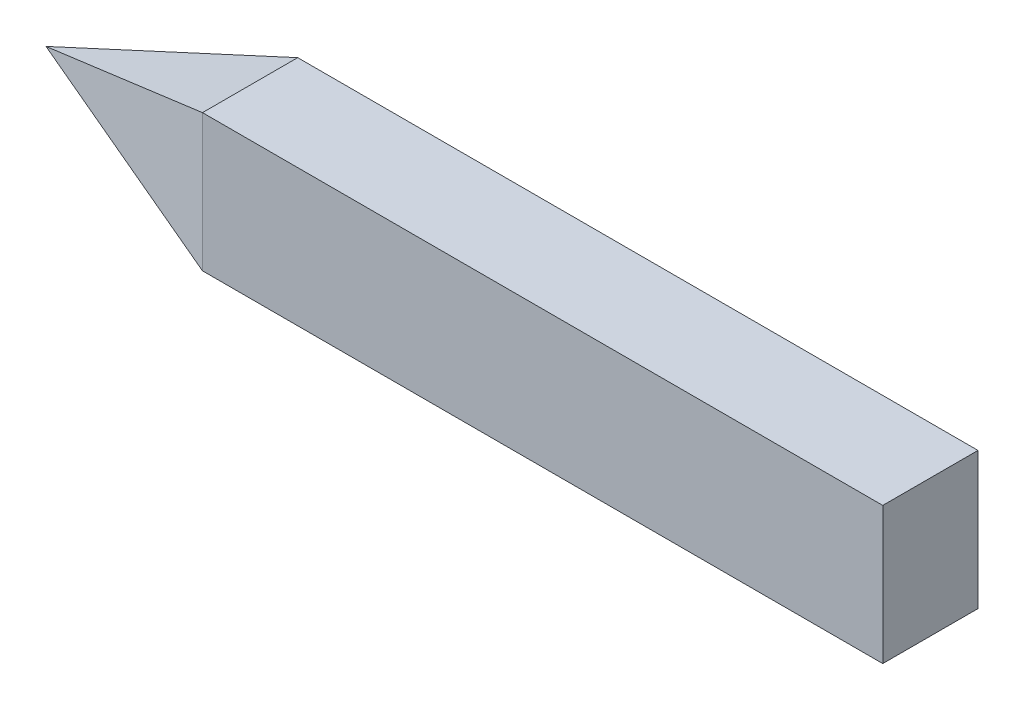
ISO-10303-21;
HEADER;
FILE_DESCRIPTION(('STEP AP214'),'2;1');
FILE_NAME('part.step','',(''),(''),'','','');
FILE_SCHEMA(('AUTOMOTIVE_DESIGN { 1 0 10303 214 1 1 1 1 }'));
ENDSEC;
DATA;
#1=APPLICATION_CONTEXT('core data for automotive mechanical design processes');
#2=APPLICATION_PROTOCOL_DEFINITION('international standard','automotive_design',2000,#1);
#3=PRODUCT_CONTEXT('',#1,'mechanical');
#4=PRODUCT('Part','Part','',(#3));
#5=PRODUCT_RELATED_PRODUCT_CATEGORY('part','',(#4));
#6=PRODUCT_DEFINITION_FORMATION('','',#4);
#7=PRODUCT_DEFINITION_CONTEXT('part definition',#1,'design');
#8=PRODUCT_DEFINITION('design','',#6,#7);
#9=PRODUCT_DEFINITION_SHAPE('','',#8);
#10=(LENGTH_UNIT() NAMED_UNIT(*) SI_UNIT(.MILLI.,.METRE.));
#11=(NAMED_UNIT(*) PLANE_ANGLE_UNIT() SI_UNIT($,.RADIAN.));
#12=(NAMED_UNIT(*) SI_UNIT($,.STERADIAN.) SOLID_ANGLE_UNIT());
#13=UNCERTAINTY_MEASURE_WITH_UNIT(LENGTH_MEASURE(1.E-05),#10,'distance_accuracy_value','');
#14=(GEOMETRIC_REPRESENTATION_CONTEXT(3) GLOBAL_UNCERTAINTY_ASSIGNED_CONTEXT((#13)) GLOBAL_UNIT_ASSIGNED_CONTEXT((#10,
#11,#12)) REPRESENTATION_CONTEXT('',''));
#15=CARTESIAN_POINT('',(0.,0.,0.));
#16=DIRECTION('',(0.,0.,1.));
#17=DIRECTION('',(1.,0.,0.));
#18=AXIS2_PLACEMENT_3D('',#15,#16,#17);
#19=CARTESIAN_POINT('',(0.,0.,0.));
#20=DIRECTION('',(0.227229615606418,0.,-0.973841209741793));
#21=DIRECTION('',(-0.973841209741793,0.,-0.227229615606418));
#22=AXIS2_PLACEMENT_3D('',#19,#20,#21);
#23=PLANE('',#22);
#24=DIRECTION('',(0.,-1.,0.));
#25=VECTOR('',#24,1.);
#26=CARTESIAN_POINT('',(75.,-109.084049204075,17.5));
#27=LINE('',#26,#25);
#28=CARTESIAN_POINT('',(75.,25.1732421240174,17.5));
#29=VERTEX_POINT('',#28);
#30=CARTESIAN_POINT('',(75.,-25.1732421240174,17.5));
#31=VERTEX_POINT('',#30);
#32=EDGE_CURVE('E74',#29,#31,#27,.T.);
#33=ORIENTED_EDGE('',*,*,#32,.F.);
#34=DIRECTION('',(0.925647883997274,0.310687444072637,0.215984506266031));
#35=VECTOR('',#34,1.);
#36=CARTESIAN_POINT('',(75.,25.1732421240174,17.5));
#37=LINE('',#36,#35);
#38=CARTESIAN_POINT('',(0.,0.,0.));
#39=VERTEX_POINT('',#38);
#40=EDGE_CURVE('E44',#39,#29,#37,.T.);
#41=ORIENTED_EDGE('',*,*,#40,.F.);
#42=DIRECTION('',(-0.925647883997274,0.310687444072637,-0.215984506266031));
#43=VECTOR('',#42,1.);
#44=CARTESIAN_POINT('',(3.49869802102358,-1.17431429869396,0.81636287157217));
#45=LINE('',#44,#43);
#46=EDGE_CURVE('E12',#31,#39,#45,.T.);
#47=ORIENTED_EDGE('',*,*,#46,.F.);
#48=EDGE_LOOP('',(#33,#41,#47));
#49=FACE_BOUND('',#48,.T.);
#50=ADVANCED_FACE('F36',(#49),#23,.F.);
#51=CARTESIAN_POINT('',(325.,-109.084049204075,-17.5));
#52=DIRECTION('',(0.,0.,-1.));
#53=DIRECTION('',(-1.,0.,0.));
#54=AXIS2_PLACEMENT_3D('',#51,#52,#53);
#55=PLANE('',#54);
#56=DIRECTION('',(0.,-1.,0.));
#57=VECTOR('',#56,1.);
#58=CARTESIAN_POINT('',(75.,-109.084049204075,-17.5));
#59=LINE('',#58,#57);
#60=CARTESIAN_POINT('',(75.,25.1732421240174,-17.5));
#61=VERTEX_POINT('',#60);
#62=CARTESIAN_POINT('',(75.,-25.1732421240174,-17.5));
#63=VERTEX_POINT('',#62);
#64=EDGE_CURVE('E117',#61,#63,#59,.T.);
#65=ORIENTED_EDGE('',*,*,#64,.F.);
#66=DIRECTION('',(-1.,0.,0.));
#67=VECTOR('',#66,1.);
#68=CARTESIAN_POINT('',(75.,25.1732421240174,-17.5));
#69=LINE('',#68,#67);
#70=CARTESIAN_POINT('',(325.,25.1732421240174,-17.5));
#71=VERTEX_POINT('',#70);
#72=EDGE_CURVE('E92',#71,#61,#69,.T.);
#73=ORIENTED_EDGE('',*,*,#72,.F.);
#74=DIRECTION('',(0.,1.,0.));
#75=VECTOR('',#74,1.);
#76=CARTESIAN_POINT('',(325.,25.1732421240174,-17.5));
#77=LINE('',#76,#75);
#78=CARTESIAN_POINT('',(325.,-25.1732421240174,-17.5));
#79=VERTEX_POINT('',#78);
#80=EDGE_CURVE('E108',#79,#71,#77,.T.);
#81=ORIENTED_EDGE('',*,*,#80,.F.);
#82=DIRECTION('',(1.,0.,0.));
#83=VECTOR('',#82,1.);
#84=CARTESIAN_POINT('',(75.,-25.1732421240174,-17.5));
#85=LINE('',#84,#83);
#86=EDGE_CURVE('E52',#63,#79,#85,.T.);
#87=ORIENTED_EDGE('',*,*,#86,.F.);
#88=EDGE_LOOP('',(#65,#73,#81,#87));
#89=FACE_BOUND('',#88,.T.);
#90=ADVANCED_FACE('F128',(#89),#55,.T.);
#91=CARTESIAN_POINT('',(325.,25.1732421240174,17.5));
#92=DIRECTION('',(-1.,0.,0.));
#93=DIRECTION('',(0.,0.,1.));
#94=AXIS2_PLACEMENT_3D('',#91,#92,#93);
#95=PLANE('',#94);
#96=ORIENTED_EDGE('',*,*,#80,.T.);
#97=DIRECTION('',(0.,0.,-1.));
#98=VECTOR('',#97,1.);
#99=CARTESIAN_POINT('',(325.,25.1732421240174,17.5));
#100=LINE('',#99,#98);
#101=CARTESIAN_POINT('',(325.,25.1732421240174,17.5));
#102=VERTEX_POINT('',#101);
#103=EDGE_CURVE('E98',#102,#71,#100,.T.);
#104=ORIENTED_EDGE('',*,*,#103,.F.);
#105=DIRECTION('',(0.,1.,0.));
#106=VECTOR('',#105,1.);
#107=CARTESIAN_POINT('',(325.,25.1732421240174,17.5));
#108=LINE('',#107,#106);
#109=CARTESIAN_POINT('',(325.,-25.1732421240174,17.5));
#110=VERTEX_POINT('',#109);
#111=EDGE_CURVE('E93',#110,#102,#108,.T.);
#112=ORIENTED_EDGE('',*,*,#111,.F.);
#113=DIRECTION('',(0.,0.,-1.));
#114=VECTOR('',#113,1.);
#115=CARTESIAN_POINT('',(325.,-25.1732421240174,17.5));
#116=LINE('',#115,#114);
#117=EDGE_CURVE('E90',#110,#79,#116,.T.);
#118=ORIENTED_EDGE('',*,*,#117,.T.);
#119=EDGE_LOOP('',(#96,#104,#112,#118));
#120=FACE_BOUND('',#119,.T.);
#121=ADVANCED_FACE('F133',(#120),#95,.F.);
#122=CARTESIAN_POINT('',(75.,-25.1732421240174,17.5));
#123=DIRECTION('',(0.,1.,0.));
#124=DIRECTION('',(0.,0.,1.));
#125=AXIS2_PLACEMENT_3D('',#122,#123,#124);
#126=PLANE('',#125);
#127=ORIENTED_EDGE('',*,*,#86,.T.);
#128=ORIENTED_EDGE('',*,*,#117,.F.);
#129=DIRECTION('',(1.,0.,0.));
#130=VECTOR('',#129,1.);
#131=CARTESIAN_POINT('',(75.,-25.1732421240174,17.5));
#132=LINE('',#131,#130);
#133=EDGE_CURVE('E69',#31,#110,#132,.T.);
#134=ORIENTED_EDGE('',*,*,#133,.F.);
#135=DIRECTION('',(0.,0.,-1.));
#136=VECTOR('',#135,1.);
#137=CARTESIAN_POINT('',(75.,-25.1732421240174,17.5));
#138=LINE('',#137,#136);
#139=EDGE_CURVE('E85',#31,#63,#138,.T.);
#140=ORIENTED_EDGE('',*,*,#139,.T.);
#141=EDGE_LOOP('',(#127,#128,#134,#140));
#142=FACE_BOUND('',#141,.T.);
#143=ADVANCED_FACE('F88',(#142),#126,.F.);
#144=CARTESIAN_POINT('',(75.,25.1732421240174,17.5));
#145=DIRECTION('',(0.,-1.,0.));
#146=DIRECTION('',(0.,0.,-1.));
#147=AXIS2_PLACEMENT_3D('',#144,#145,#146);
#148=PLANE('',#147);
#149=ORIENTED_EDGE('',*,*,#72,.T.);
#150=DIRECTION('',(0.,0.,-1.));
#151=VECTOR('',#150,1.);
#152=CARTESIAN_POINT('',(75.,25.1732421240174,17.5));
#153=LINE('',#152,#151);
#154=EDGE_CURVE('E103',#29,#61,#153,.T.);
#155=ORIENTED_EDGE('',*,*,#154,.F.);
#156=DIRECTION('',(-1.,0.,0.));
#157=VECTOR('',#156,1.);
#158=CARTESIAN_POINT('',(75.,25.1732421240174,17.5));
#159=LINE('',#158,#157);
#160=EDGE_CURVE('E82',#102,#29,#159,.T.);
#161=ORIENTED_EDGE('',*,*,#160,.F.);
#162=ORIENTED_EDGE('',*,*,#103,.T.);
#163=EDGE_LOOP('',(#149,#155,#161,#162));
#164=FACE_BOUND('',#163,.T.);
#165=ADVANCED_FACE('F135',(#164),#148,.F.);
#166=CARTESIAN_POINT('',(325.,-109.084049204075,17.5));
#167=DIRECTION('',(0.,0.,-1.));
#168=DIRECTION('',(-1.,0.,0.));
#169=AXIS2_PLACEMENT_3D('',#166,#167,#168);
#170=PLANE('',#169);
#171=ORIENTED_EDGE('',*,*,#160,.T.);
#172=ORIENTED_EDGE('',*,*,#32,.T.);
#173=ORIENTED_EDGE('',*,*,#133,.T.);
#174=ORIENTED_EDGE('',*,*,#111,.T.);
#175=EDGE_LOOP('',(#171,#172,#173,#174));
#176=FACE_BOUND('',#175,.T.);
#177=ADVANCED_FACE('F80',(#176),#170,.F.);
#178=CARTESIAN_POINT('',(0.,0.,0.));
#179=DIRECTION('',(-0.227229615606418,0.,-0.973841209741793));
#180=DIRECTION('',(-0.973841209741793,0.,0.227229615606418));
#181=AXIS2_PLACEMENT_3D('',#178,#179,#180);
#182=PLANE('',#181);
#183=ORIENTED_EDGE('',*,*,#64,.T.);
#184=DIRECTION('',(-0.925647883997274,0.310687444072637,0.215984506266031));
#185=VECTOR('',#184,1.);
#186=CARTESIAN_POINT('',(-3.49869802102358,1.17431429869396,0.81636287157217));
#187=LINE('',#186,#185);
#188=EDGE_CURVE('E86',#63,#39,#187,.T.);
#189=ORIENTED_EDGE('',*,*,#188,.T.);
#190=DIRECTION('',(0.925647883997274,0.310687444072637,-0.215984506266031));
#191=VECTOR('',#190,1.);
#192=CARTESIAN_POINT('',(68.0026039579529,22.8246135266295,-15.8672742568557));
#193=LINE('',#192,#191);
#194=EDGE_CURVE('E114',#39,#61,#193,.T.);
#195=ORIENTED_EDGE('',*,*,#194,.T.);
#196=EDGE_LOOP('',(#183,#189,#195));
#197=FACE_BOUND('',#196,.T.);
#198=ADVANCED_FACE('F124',(#197),#182,.T.);
#199=CARTESIAN_POINT('',(75.,25.1732421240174,17.5));
#200=DIRECTION('',(0.318197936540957,-0.948024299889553,0.));
#201=DIRECTION('',(0.948024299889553,0.318197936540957,0.));
#202=AXIS2_PLACEMENT_3D('',#199,#200,#201);
#203=PLANE('',#202);
#204=ORIENTED_EDGE('',*,*,#194,.F.);
#205=ORIENTED_EDGE('',*,*,#40,.T.);
#206=ORIENTED_EDGE('',*,*,#154,.T.);
#207=EDGE_LOOP('',(#204,#205,#206));
#208=FACE_BOUND('',#207,.T.);
#209=ADVANCED_FACE('F120',(#208),#203,.F.);
#210=CARTESIAN_POINT('',(0.,0.,17.5));
#211=DIRECTION('',(0.318197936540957,0.948024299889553,0.));
#212=DIRECTION('',(-0.948024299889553,0.318197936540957,0.));
#213=AXIS2_PLACEMENT_3D('',#210,#211,#212);
#214=PLANE('',#213);
#215=ORIENTED_EDGE('',*,*,#139,.F.);
#216=ORIENTED_EDGE('',*,*,#46,.T.);
#217=ORIENTED_EDGE('',*,*,#188,.F.);
#218=EDGE_LOOP('',(#215,#216,#217));
#219=FACE_BOUND('',#218,.T.);
#220=ADVANCED_FACE('F95',(#219),#214,.F.);
#221=CLOSED_SHELL('',(#50,#90,#121,#143,#165,#177,#198,#209,#220));
#222=MANIFOLD_SOLID_BREP('B2',#221);
#223=ADVANCED_BREP_SHAPE_REPRESENTATION('',(#18,#222),#14);
#224=SHAPE_DEFINITION_REPRESENTATION(#9,#223);
ENDSEC;
END-ISO-10303-21;
